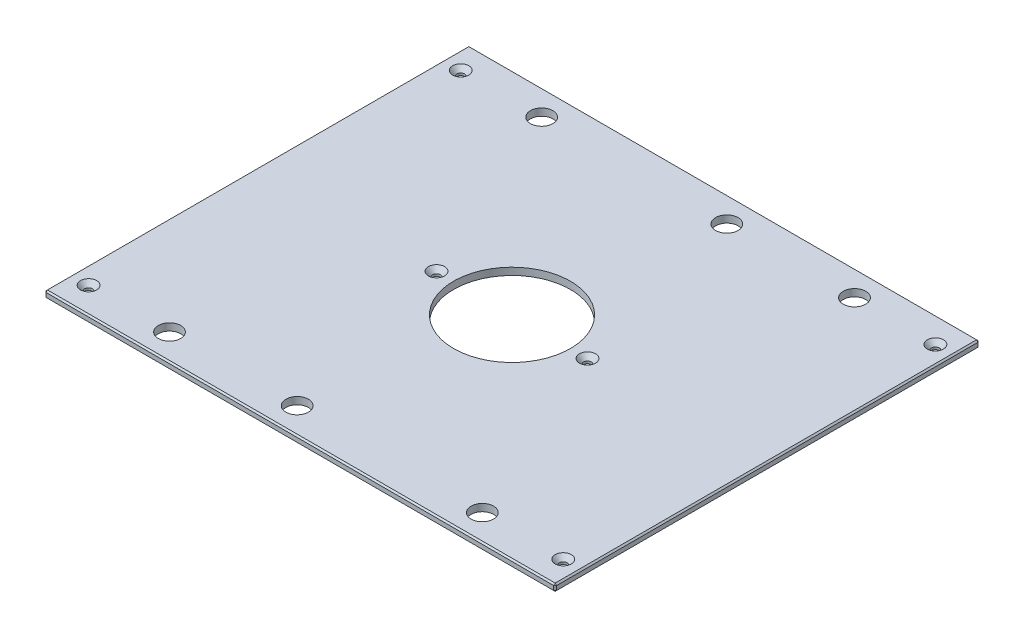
from build123d import *

# Parameters (mm, degrees)
SKETCH1_W                                     = 450.85
SKETCH1_H                                     = 374.65
BOSS_EXTRUDE1_DEPTH                           = 6.35
SKETCH13_R                                    = 51.562
CUT_EXTRUDE6_DEPTH                            = 294.167884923
F_25_32_0_78125_DIAMETER_HOLE1_D              = 19.84375
CHAMFER2_SIZE                                 = 1.27
CSK_FOR_1_4_FLAT_HEAD_MACHINE_SCREW1_AT_COUNT = 2
CSK_FOR_1_4_FLAT_HEAD_MACHINE_SCREW1_AT_PITCH = 328.60996
CSK_FOR_1_4_FLAT_HEAD_MACHINE_SCREW1_2_COUNT  = 2
CSK_FOR_1_4_FLAT_HEAD_MACHINE_SCREW1_2_PITCH  = 532.568601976
CSK_FOR_1_4_FLAT_HEAD_MACHINE_SCREW1_3_COUNT  = 2
CSK_FOR_1_4_FLAT_HEAD_MACHINE_SCREW1_3_PITCH  = 321.397537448
CSK_FOR_1_4_FLAT_HEAD_MACHINE_SCREW1_4_COUNT  = 2
CSK_FOR_1_4_FLAT_HEAD_MACHINE_SCREW1_4_PITCH  = 217.736979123
CSK_FOR_1_4_FLAT_HEAD_MACHINE_SCREW1_5_COUNT  = 2
CSK_FOR_1_4_FLAT_HEAD_MACHINE_SCREW1_5_PITCH  = 419.1
CSK_FOR_1_4_FLAT_HEAD_MACHINE_SCREW1_6_COUNT  = 2
CSK_FOR_1_4_FLAT_HEAD_MACHINE_SCREW1_6_PITCH  = 347.6625
CSK_FOR_1_4_FLAT_HEAD_MACHINE_SCREW1_7_COUNT  = 2
CSK_FOR_1_4_FLAT_HEAD_MACHINE_SCREW1_7_PITCH  = 478.386579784


with BuildPart() as part:
    # Sketch1 → Boss-Extrude1 (new body)
    with BuildSketch(Plane(origin=(0, 0, 0), x_dir=(1, 0, 0), z_dir=(0, 1, 0))):
        Rectangle(SKETCH1_W, SKETCH1_H)
    extrude(amount=BOSS_EXTRUDE1_DEPTH)

    # Sketch13 → Cut-Extrude6 (cut, through all)
    with BuildSketch(Plane(origin=(0, 6.35, 0), x_dir=(1, 0, 0), z_dir=(0, 1, 0))):
        with Locations(Location((0, 0, 0), (0, 0, 270))):
            Circle(SKETCH13_R)
    extrude(amount=-CUT_EXTRUDE6_DEPTH, mode=Mode.SUBTRACT)

    # 25_32 _0.78125_ Diameter Hole1 (through all)
    with Locations(Plane(origin=(0, 6.35, 0), x_dir=(1, 0, 0), z_dir=(0, 1, 0))):
        with Locations((138.1125, 164.30498), (-138.1125, 164.30498), (138.1125, -164.30498), (-138.1125, -164.30498), (25.4, 164.30498), (-25.4, -164.30498)):
            Hole(F_25_32_0_78125_DIAMETER_HOLE1_D / 2)

    # Chamfer2
    chamfer2_edges = [part.edges().sort_by_distance(p)[0] for p in [
        (225.425, 6.35, 0),
        (0, 6.35, -187.325),
        (-225.425, 6.35, 0),
        (0, 0, -187.325),
        (225.425, 0, 0),
        (0, 0, 187.325),
        (-225.425, 0, 0),
        (0, 6.35, 187.325),
        (-225.425, 3.175, -187.325),
        (225.425, 3.175, -187.325),
        (225.425, 3.175, 187.325),
        (-225.425, 3.175, 187.325),
    ]]
    chamfer(chamfer2_edges, length=CHAMFER2_SIZE)

    # Sketch24 → CSK for 1_4 Flat Head Machine Screw1 (revolve, cut)
    with BuildSketch(Plane(origin=(209.55, 6.35, -164.30498), x_dir=(0, 0, 1), z_dir=(1, 0, 0))):
        Polygon((0, 0), (0, 6.35), (3.3782, 6.35), (3.3782, 4.324464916), (7.1374, 0), align=None)
    csk_for_1_4_flat_head_machine_screw1 = revolve(axis=Axis((209.55, 12.7, -164.30498), (0, -1, 0)), mode=Mode.SUBTRACT)

    # CSK for 1_4 Flat Head Machine Screw1 at: CSK for 1_4 Flat Head Machine Screw1 ×2
    with Locations(*[(0, 0, i * CSK_FOR_1_4_FLAT_HEAD_MACHINE_SCREW1_AT_PITCH) for i in range(1, CSK_FOR_1_4_FLAT_HEAD_MACHINE_SCREW1_AT_COUNT)]):
        add(csk_for_1_4_flat_head_machine_screw1, mode=Mode.SUBTRACT)

    # CSK for 1_4 Flat Head Machine Screw1 2: CSK for 1_4 Flat Head Machine Screw1 ×2
    with Locations(*[Vector(-0.7869408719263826, 0, 0.6170284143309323) * (i * CSK_FOR_1_4_FLAT_HEAD_MACHINE_SCREW1_2_PITCH) for i in range(1, CSK_FOR_1_4_FLAT_HEAD_MACHINE_SCREW1_2_COUNT)]):
        add(csk_for_1_4_flat_head_machine_screw1, mode=Mode.SUBTRACT)

    # CSK for 1_4 Flat Head Machine Screw1 3: CSK for 1_4 Flat Head Machine Screw1 ×2
    with Locations(*[Vector(-0.8594496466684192, 0, 0.5112204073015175) * (i * CSK_FOR_1_4_FLAT_HEAD_MACHINE_SCREW1_3_PITCH) for i in range(1, CSK_FOR_1_4_FLAT_HEAD_MACHINE_SCREW1_3_COUNT)]):
        add(csk_for_1_4_flat_head_machine_screw1, mode=Mode.SUBTRACT)

    # CSK for 1_4 Flat Head Machine Screw1 4: CSK for 1_4 Flat Head Machine Screw1 ×2
    with Locations(*[Vector(-0.6561816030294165, 0, 0.7546030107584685) * (i * CSK_FOR_1_4_FLAT_HEAD_MACHINE_SCREW1_4_PITCH) for i in range(1, CSK_FOR_1_4_FLAT_HEAD_MACHINE_SCREW1_4_COUNT)]):
        add(csk_for_1_4_flat_head_machine_screw1, mode=Mode.SUBTRACT)

    # CSK for 1_4 Flat Head Machine Screw1 5: CSK for 1_4 Flat Head Machine Screw1 ×2
    with Locations(*[(-i * CSK_FOR_1_4_FLAT_HEAD_MACHINE_SCREW1_5_PITCH, 0, 0) for i in range(1, CSK_FOR_1_4_FLAT_HEAD_MACHINE_SCREW1_5_COUNT)]):
        add(csk_for_1_4_flat_head_machine_screw1, mode=Mode.SUBTRACT)

    # CSK for 1_4 Flat Head Machine Screw1 6: CSK for 1_4 Flat Head Machine Screw1 ×2
    with Locations(*[(-i * CSK_FOR_1_4_FLAT_HEAD_MACHINE_SCREW1_6_PITCH, 0, 0) for i in range(1, CSK_FOR_1_4_FLAT_HEAD_MACHINE_SCREW1_6_COUNT)]):
        add(csk_for_1_4_flat_head_machine_screw1, mode=Mode.SUBTRACT)

    # CSK for 1_4 Flat Head Machine Screw1 7: CSK for 1_4 Flat Head Machine Screw1 ×2
    with Locations(*[Vector(-0.7267396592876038, 0, 0.6869129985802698) * (i * CSK_FOR_1_4_FLAT_HEAD_MACHINE_SCREW1_7_PITCH) for i in range(1, CSK_FOR_1_4_FLAT_HEAD_MACHINE_SCREW1_7_COUNT)]):
        add(csk_for_1_4_flat_head_machine_screw1, mode=Mode.SUBTRACT)


solid = part.part
